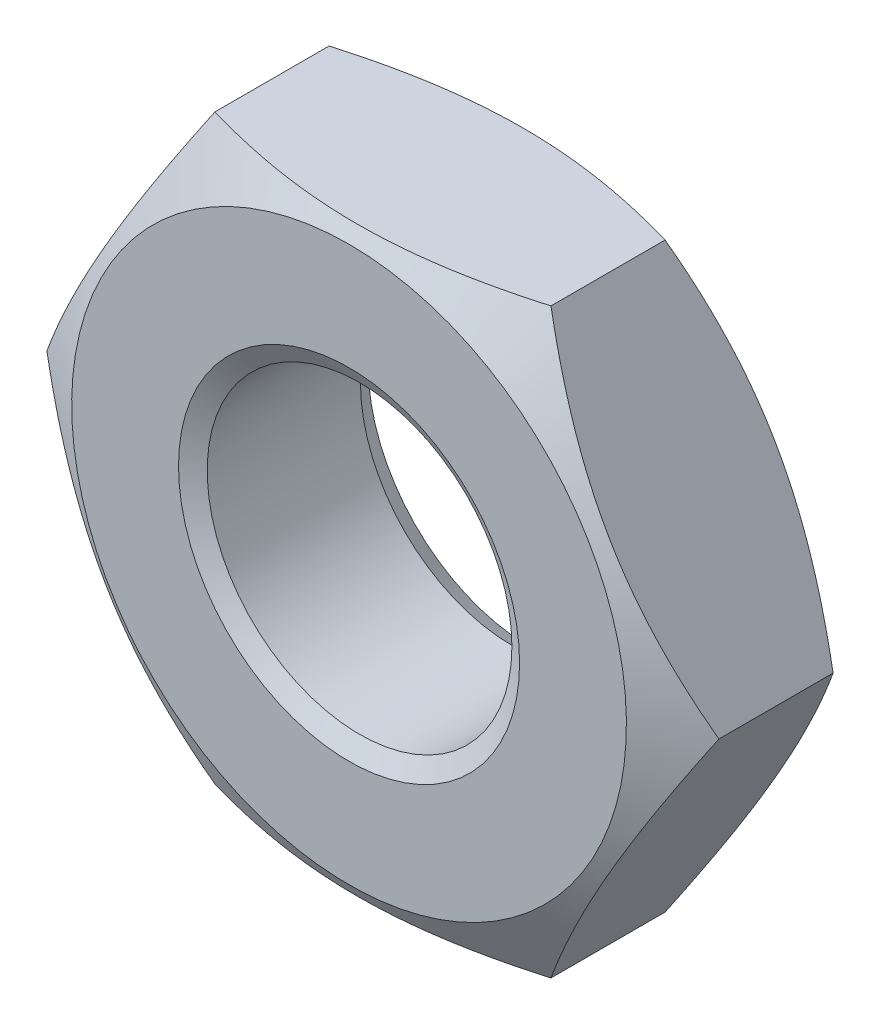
ISO-10303-21;
HEADER;
FILE_DESCRIPTION(('STEP AP214'),'2;1');
FILE_NAME('part.step','',(''),(''),'','','');
FILE_SCHEMA(('AUTOMOTIVE_DESIGN { 1 0 10303 214 1 1 1 1 }'));
ENDSEC;
DATA;
#1=APPLICATION_CONTEXT('core data for automotive mechanical design processes');
#2=APPLICATION_PROTOCOL_DEFINITION('international standard','automotive_design',2000,#1);
#3=PRODUCT_CONTEXT('',#1,'mechanical');
#4=PRODUCT('Part','Part','',(#3));
#5=PRODUCT_RELATED_PRODUCT_CATEGORY('part','',(#4));
#6=PRODUCT_DEFINITION_FORMATION('','',#4);
#7=PRODUCT_DEFINITION_CONTEXT('part definition',#1,'design');
#8=PRODUCT_DEFINITION('design','',#6,#7);
#9=PRODUCT_DEFINITION_SHAPE('','',#8);
#10=(LENGTH_UNIT() NAMED_UNIT(*) SI_UNIT(.MILLI.,.METRE.));
#11=(NAMED_UNIT(*) PLANE_ANGLE_UNIT() SI_UNIT($,.RADIAN.));
#12=(NAMED_UNIT(*) SI_UNIT($,.STERADIAN.) SOLID_ANGLE_UNIT());
#13=UNCERTAINTY_MEASURE_WITH_UNIT(LENGTH_MEASURE(1.E-05),#10,'distance_accuracy_value','');
#14=(GEOMETRIC_REPRESENTATION_CONTEXT(3) GLOBAL_UNCERTAINTY_ASSIGNED_CONTEXT((#13)) GLOBAL_UNIT_ASSIGNED_CONTEXT((#10,
#11,#12)) REPRESENTATION_CONTEXT('',''));
#15=CARTESIAN_POINT('',(0.,0.,0.));
#16=DIRECTION('',(0.,0.,1.));
#17=DIRECTION('',(1.,0.,0.));
#18=AXIS2_PLACEMENT_3D('',#15,#16,#17);
#19=CARTESIAN_POINT('',(-4.618802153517,-8.,0.));
#20=DIRECTION('',(0.,0.,-1.));
#21=DIRECTION('',(-1.,0.,0.));
#22=AXIS2_PLACEMENT_3D('',#19,#20,#21);
#23=PLANE('',#22);
#24=CARTESIAN_POINT('',(0.,0.,0.));
#25=DIRECTION('',(0.,0.,-1.));
#26=DIRECTION('',(0.,1.,0.));
#27=AXIS2_PLACEMENT_3D('',#24,#25,#26);
#28=CIRCLE('',#27,7.625);
#29=CARTESIAN_POINT('',(0.,7.625,0.));
#30=VERTEX_POINT('',#29);
#31=EDGE_CURVE('E136',#30,#30,#28,.T.);
#32=ORIENTED_EDGE('',*,*,#31,.F.);
#33=EDGE_LOOP('',(#32));
#34=FACE_BOUND('',#33,.T.);
#35=CARTESIAN_POINT('',(0.,0.,5.6843418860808E-11));
#36=DIRECTION('',(0.,0.,1.));
#37=DIRECTION('',(1.,0.,0.));
#38=AXIS2_PLACEMENT_3D('',#35,#36,#37);
#39=CIRCLE('',#38,4.68799999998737);
#40=CARTESIAN_POINT('',(4.68799999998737,0.,5.6843418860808E-11));
#41=VERTEX_POINT('',#40);
#42=EDGE_CURVE('E20',#41,#41,#39,.F.);
#43=ORIENTED_EDGE('',*,*,#42,.T.);
#44=EDGE_LOOP('',(#43));
#45=FACE_BOUND('',#44,.T.);
#46=ADVANCED_FACE('F17',(#34,#45),#23,.F.);
#47=CARTESIAN_POINT('',(0.,0.,5.6843418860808E-11));
#48=DIRECTION('',(0.,0.,1.));
#49=DIRECTION('',(1.,0.,0.));
#50=AXIS2_PLACEMENT_3D('',#47,#48,#49);
#51=CONICAL_SURFACE('',#50,4.68799999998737,1.04719755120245);
#52=CARTESIAN_POINT('',(0.,0.,-0.288675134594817));
#53=DIRECTION('',(0.,0.,1.));
#54=DIRECTION('',(1.,0.,0.));
#55=AXIS2_PLACEMENT_3D('',#52,#53,#54);
#56=CIRCLE('',#55,4.188);
#57=CARTESIAN_POINT('',(4.188,0.,-0.288675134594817));
#58=VERTEX_POINT('',#57);
#59=EDGE_CURVE('E71',#58,#58,#56,.F.);
#60=ORIENTED_EDGE('',*,*,#59,.T.);
#61=EDGE_LOOP('',(#60));
#62=FACE_BOUND('',#61,.T.);
#63=ORIENTED_EDGE('',*,*,#42,.F.);
#64=EDGE_LOOP('',(#63));
#65=FACE_BOUND('',#64,.T.);
#66=ADVANCED_FACE('F111',(#62,#65),#51,.F.);
#67=CARTESIAN_POINT('',(0.,0.,-0.936623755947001));
#68=DIRECTION('',(0.,0.,-1.));
#69=DIRECTION('',(0.,1.,0.));
#70=AXIS2_PLACEMENT_3D('',#67,#68,#69);
#71=CONICAL_SURFACE('',#70,9.24727993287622,1.0471975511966);
#72=CARTESIAN_POINT('',(9.23760430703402,0.,-0.931037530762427));
#73=CARTESIAN_POINT('',(9.13607893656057,-0.175847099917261,-0.872433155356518));
#74=CARTESIAN_POINT('',(9.03417504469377,-0.352349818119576,-0.81648866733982));
#75=CARTESIAN_POINT('',(8.82953967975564,-0.70678866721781,-0.710652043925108));
#76=CARTESIAN_POINT('',(8.72680786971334,-0.884725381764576,-0.660762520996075));
#77=CARTESIAN_POINT('',(8.41696767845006,-1.42138433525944,-0.521155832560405));
#78=CARTESIAN_POINT('',(8.20863625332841,-1.78222494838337,-0.441750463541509));
#79=CARTESIAN_POINT('',(7.89687232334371,-2.32221591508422,-0.348640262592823));
#80=CARTESIAN_POINT('',(7.79437112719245,-2.49975319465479,-0.322116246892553));
#81=CARTESIAN_POINT('',(7.5889052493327,-2.8556305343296,-0.27764091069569));
#82=CARTESIAN_POINT('',(7.48594060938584,-3.03397052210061,-0.259688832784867));
#83=CARTESIAN_POINT('',(7.2798340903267,-3.3909574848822,-0.232812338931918));
#84=CARTESIAN_POINT('',(7.17669254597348,-3.5696038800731,-0.223877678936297));
#85=CARTESIAN_POINT('',(6.97031423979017,-3.9270615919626,-0.215227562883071));
#86=CARTESIAN_POINT('',(6.86707748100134,-4.10587290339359,-0.215511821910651));
#87=CARTESIAN_POINT('',(6.67408002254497,-4.44015430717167,-0.224657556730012));
#88=CARTESIAN_POINT('',(6.58430568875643,-4.59564801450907,-0.232403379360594));
#89=CARTESIAN_POINT('',(6.40496729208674,-4.90627122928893,-0.254716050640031));
#90=CARTESIAN_POINT('',(6.31540324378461,-5.06140071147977,-0.269283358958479));
#91=CARTESIAN_POINT('',(6.04705785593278,-5.52618855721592,-0.322873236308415));
#92=CARTESIAN_POINT('',(5.86875148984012,-5.83502424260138,-0.371777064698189));
#93=CARTESIAN_POINT('',(5.51024760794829,-6.4559711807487,-0.494034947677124));
#94=CARTESIAN_POINT('',(5.33009583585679,-6.76800320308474,-0.567907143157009));
#95=CARTESIAN_POINT('',(4.97247850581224,-7.38741458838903,-0.735565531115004));
#96=CARTESIAN_POINT('',(4.79500836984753,-7.69480188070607,-0.829312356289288));
#97=CARTESIAN_POINT('',(4.61880215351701,-8.,-0.931037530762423));
#98=B_SPLINE_CURVE_WITH_KNOTS('',3,(#72,#73,#74,#75,#76,#77,#78,#79,#80,#81,#82,#83,#84,#85,#86,
#87,#88,#89,#90,#91,#92,#93,#94,#95,#96,#97),.UNSPECIFIED.,.F.,.F.,(4,2,2,2,2,2,2,2,2,2,2,2,4),
(0.,0.633965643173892,1.26820385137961,2.53931507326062,3.15930423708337,3.77923860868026,
4.39846792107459,5.01767809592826,5.55669078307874,6.09573979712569,7.17460544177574,
8.27739515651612,9.37802056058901),.UNSPECIFIED.);
#99=CARTESIAN_POINT('',(9.23760430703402,0.,-0.931037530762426));
#100=VERTEX_POINT('',#99);
#101=CARTESIAN_POINT('',(4.61880215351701,-8.,-0.931037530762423));
#102=VERTEX_POINT('',#101);
#103=EDGE_CURVE('E62',#100,#102,#98,.T.);
#104=ORIENTED_EDGE('',*,*,#103,.F.);
#105=CARTESIAN_POINT('',(4.618802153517,8.00000000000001,-0.931037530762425));
#106=CARTESIAN_POINT('',(4.72032752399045,7.82415290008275,-0.872433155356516));
#107=CARTESIAN_POINT('',(4.82223141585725,7.64765018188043,-0.816488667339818));
#108=CARTESIAN_POINT('',(5.02686678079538,7.2932113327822,-0.710652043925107));
#109=CARTESIAN_POINT('',(5.12959859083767,7.11527461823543,-0.660762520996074));
#110=CARTESIAN_POINT('',(5.43943878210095,6.57861566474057,-0.521155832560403));
#111=CARTESIAN_POINT('',(5.6477702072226,6.21777505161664,-0.441750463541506));
#112=CARTESIAN_POINT('',(5.95953413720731,5.67778408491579,-0.348640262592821));
#113=CARTESIAN_POINT('',(6.06203533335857,5.50024680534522,-0.322116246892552));
#114=CARTESIAN_POINT('',(6.26750121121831,5.1443694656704,-0.277640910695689));
#115=CARTESIAN_POINT('',(6.37046585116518,4.9660294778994,-0.259688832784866));
#116=CARTESIAN_POINT('',(6.57657237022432,4.6090425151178,-0.232812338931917));
#117=CARTESIAN_POINT('',(6.67971391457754,4.4303961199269,-0.223877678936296));
#118=CARTESIAN_POINT('',(6.88609222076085,4.07293840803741,-0.215227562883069));
#119=CARTESIAN_POINT('',(6.98932897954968,3.89412709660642,-0.215511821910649));
#120=CARTESIAN_POINT('',(7.18232643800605,3.55984569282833,-0.224657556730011));
#121=CARTESIAN_POINT('',(7.27210077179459,3.40435198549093,-0.232403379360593));
#122=CARTESIAN_POINT('',(7.45143916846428,3.09372877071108,-0.25471605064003));
#123=CARTESIAN_POINT('',(7.54100321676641,2.93859928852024,-0.269283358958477));
#124=CARTESIAN_POINT('',(7.80934860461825,2.47381144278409,-0.322873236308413));
#125=CARTESIAN_POINT('',(7.9876549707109,2.16497575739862,-0.371777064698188));
#126=CARTESIAN_POINT('',(8.34615885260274,1.5440288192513,-0.494034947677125));
#127=CARTESIAN_POINT('',(8.52631062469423,1.23199679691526,-0.567907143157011));
#128=CARTESIAN_POINT('',(8.88392795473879,0.612585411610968,-0.735565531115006));
#129=CARTESIAN_POINT('',(9.0613980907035,0.305198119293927,-0.829312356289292));
#130=CARTESIAN_POINT('',(9.23760430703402,0.,-0.931037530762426));
#131=B_SPLINE_CURVE_WITH_KNOTS('',3,(#105,#106,#107,#108,#109,#110,#111,#112,#113,#114,#115,
#116,#117,#118,#119,#120,#121,#122,#123,#124,#125,#126,#127,#128,#129,#130),.UNSPECIFIED.,.F.,
.F.,(4,2,2,2,2,2,2,2,2,2,2,2,4),(0.,0.63396564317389,1.26820385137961,2.53931507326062,
3.15930423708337,3.77923860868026,4.39846792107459,5.01767809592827,5.55669078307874,
6.09573979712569,7.17460544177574,8.27739515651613,9.37802056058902),.UNSPECIFIED.);
#132=CARTESIAN_POINT('',(4.618802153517,8.,-0.931037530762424));
#133=VERTEX_POINT('',#132);
#134=EDGE_CURVE('E66',#133,#100,#131,.T.);
#135=ORIENTED_EDGE('',*,*,#134,.F.);
#136=CARTESIAN_POINT('',(-4.61880215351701,8.,-0.931037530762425));
#137=CARTESIAN_POINT('',(-4.41575141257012,8.,-0.872433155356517));
#138=CARTESIAN_POINT('',(-4.21194362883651,8.,-0.816488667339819));
#139=CARTESIAN_POINT('',(-3.80267289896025,8.,-0.710652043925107));
#140=CARTESIAN_POINT('',(-3.59720927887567,8.,-0.660762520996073));
#141=CARTESIAN_POINT('',(-2.9775288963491,8.,-0.521155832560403));
#142=CARTESIAN_POINT('',(-2.5608660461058,8.,-0.441750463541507));
#143=CARTESIAN_POINT('',(-1.9373381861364,8.,-0.348640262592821));
#144=CARTESIAN_POINT('',(-1.73233579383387,8.,-0.322116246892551));
#145=CARTESIAN_POINT('',(-1.32140403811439,8.,-0.277640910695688));
#146=CARTESIAN_POINT('',(-1.11547475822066,8.,-0.259688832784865));
#147=CARTESIAN_POINT('',(-0.703261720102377,8.,-0.232812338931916));
#148=CARTESIAN_POINT('',(-0.496978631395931,8.,-0.223877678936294));
#149=CARTESIAN_POINT('',(-0.0842220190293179,8.,-0.215227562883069));
#150=CARTESIAN_POINT('',(0.122251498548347,8.,-0.215511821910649));
#151=CARTESIAN_POINT('',(0.508246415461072,8.,-0.22465755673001));
#152=CARTESIAN_POINT('',(0.687795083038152,8.,-0.232403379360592));
#153=CARTESIAN_POINT('',(1.04647187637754,8.,-0.254716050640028));
#154=CARTESIAN_POINT('',(1.2255999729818,8.,-0.269283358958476));
#155=CARTESIAN_POINT('',(1.76229074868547,8.,-0.322873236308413));
#156=CARTESIAN_POINT('',(2.11890348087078,8.,-0.371777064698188));
#157=CARTESIAN_POINT('',(2.83591124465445,8.,-0.494034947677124));
#158=CARTESIAN_POINT('',(3.19621478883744,8.,-0.567907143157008));
#159=CARTESIAN_POINT('',(3.91144944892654,8.,-0.735565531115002));
#160=CARTESIAN_POINT('',(4.26638972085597,8.,-0.829312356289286));
#161=CARTESIAN_POINT('',(4.618802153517,8.,-0.931037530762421));
#162=B_SPLINE_CURVE_WITH_KNOTS('',3,(#136,#137,#138,#139,#140,#141,#142,#143,#144,#145,#146,
#147,#148,#149,#150,#151,#152,#153,#154,#155,#156,#157,#158,#159,#160,#161),.UNSPECIFIED.,.F.,
.F.,(4,2,2,2,2,2,2,2,2,2,2,2,4),(0.,0.63396564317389,1.26820385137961,2.53931507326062,
3.15930423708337,3.77923860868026,4.39846792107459,5.01767809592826,5.55669078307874,
6.09573979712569,7.17460544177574,8.27739515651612,9.37802056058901),.UNSPECIFIED.);
#163=CARTESIAN_POINT('',(-4.61880215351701,8.,-0.931037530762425));
#164=VERTEX_POINT('',#163);
#165=EDGE_CURVE('E85',#164,#133,#162,.T.);
#166=ORIENTED_EDGE('',*,*,#165,.F.);
#167=CARTESIAN_POINT('',(-9.23760430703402,0.,-0.931037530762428));
#168=CARTESIAN_POINT('',(-9.13607893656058,0.17584709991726,-0.872433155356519));
#169=CARTESIAN_POINT('',(-9.03417504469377,0.352349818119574,-0.81648866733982));
#170=CARTESIAN_POINT('',(-8.82953967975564,0.706788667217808,-0.710652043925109));
#171=CARTESIAN_POINT('',(-8.72680786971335,0.884725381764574,-0.660762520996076));
#172=CARTESIAN_POINT('',(-8.41696767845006,1.42138433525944,-0.521155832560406));
#173=CARTESIAN_POINT('',(-8.20863625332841,1.78222494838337,-0.441750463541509));
#174=CARTESIAN_POINT('',(-7.89687232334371,2.32221591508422,-0.348640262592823));
#175=CARTESIAN_POINT('',(-7.79437112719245,2.49975319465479,-0.322116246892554));
#176=CARTESIAN_POINT('',(-7.58890524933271,2.85563053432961,-0.277640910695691));
#177=CARTESIAN_POINT('',(-7.48594060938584,3.03397052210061,-0.259688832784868));
#178=CARTESIAN_POINT('',(-7.2798340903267,3.3909574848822,-0.23281233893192));
#179=CARTESIAN_POINT('',(-7.17669254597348,3.5696038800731,-0.223877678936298));
#180=CARTESIAN_POINT('',(-6.97031423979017,3.9270615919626,-0.215227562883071));
#181=CARTESIAN_POINT('',(-6.86707748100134,4.10587290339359,-0.215511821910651));
#182=CARTESIAN_POINT('',(-6.67408002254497,4.44015430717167,-0.224657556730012));
#183=CARTESIAN_POINT('',(-6.58430568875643,4.59564801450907,-0.232403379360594));
#184=CARTESIAN_POINT('',(-6.40496729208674,4.90627122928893,-0.254716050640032));
#185=CARTESIAN_POINT('',(-6.31540324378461,5.06140071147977,-0.269283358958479));
#186=CARTESIAN_POINT('',(-6.04705785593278,5.52618855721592,-0.322873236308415));
#187=CARTESIAN_POINT('',(-5.86875148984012,5.83502424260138,-0.37177706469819));
#188=CARTESIAN_POINT('',(-5.51024760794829,6.4559711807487,-0.494034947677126));
#189=CARTESIAN_POINT('',(-5.33009583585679,6.76800320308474,-0.567907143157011));
#190=CARTESIAN_POINT('',(-4.97247850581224,7.38741458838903,-0.735565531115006));
#191=CARTESIAN_POINT('',(-4.79500836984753,7.69480188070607,-0.829312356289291));
#192=CARTESIAN_POINT('',(-4.61880215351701,8.,-0.931037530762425));
#193=B_SPLINE_CURVE_WITH_KNOTS('',3,(#167,#168,#169,#170,#171,#172,#173,#174,#175,#176,#177,
#178,#179,#180,#181,#182,#183,#184,#185,#186,#187,#188,#189,#190,#191,#192),.UNSPECIFIED.,.F.,
.F.,(4,2,2,2,2,2,2,2,2,2,2,2,4),(0.,0.633965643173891,1.26820385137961,2.53931507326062,
3.15930423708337,3.77923860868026,4.39846792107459,5.01767809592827,5.55669078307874,
6.09573979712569,7.17460544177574,8.27739515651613,9.37802056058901),.UNSPECIFIED.);
#194=CARTESIAN_POINT('',(-9.23760430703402,0.,-0.931037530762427));
#195=VERTEX_POINT('',#194);
#196=EDGE_CURVE('E114',#195,#164,#193,.T.);
#197=ORIENTED_EDGE('',*,*,#196,.F.);
#198=CARTESIAN_POINT('',(-4.618802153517,-8.00000000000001,-0.931037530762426));
#199=CARTESIAN_POINT('',(-4.72032752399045,-7.82415290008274,-0.872433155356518));
#200=CARTESIAN_POINT('',(-4.82223141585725,-7.64765018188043,-0.816488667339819));
#201=CARTESIAN_POINT('',(-5.02686678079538,-7.2932113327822,-0.710652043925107));
#202=CARTESIAN_POINT('',(-5.12959859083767,-7.11527461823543,-0.660762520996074));
#203=CARTESIAN_POINT('',(-5.43943878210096,-6.57861566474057,-0.521155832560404));
#204=CARTESIAN_POINT('',(-5.64777020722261,-6.21777505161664,-0.441750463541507));
#205=CARTESIAN_POINT('',(-5.95953413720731,-5.67778408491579,-0.348640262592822));
#206=CARTESIAN_POINT('',(-6.06203533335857,-5.50024680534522,-0.322116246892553));
#207=CARTESIAN_POINT('',(-6.26750121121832,-5.1443694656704,-0.277640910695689));
#208=CARTESIAN_POINT('',(-6.37046585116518,-4.9660294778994,-0.259688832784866));
#209=CARTESIAN_POINT('',(-6.57657237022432,-4.6090425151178,-0.232812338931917));
#210=CARTESIAN_POINT('',(-6.67971391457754,-4.4303961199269,-0.223877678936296));
#211=CARTESIAN_POINT('',(-6.88609222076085,-4.07293840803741,-0.21522756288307));
#212=CARTESIAN_POINT('',(-6.98932897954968,-3.89412709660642,-0.215511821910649));
#213=CARTESIAN_POINT('',(-7.18232643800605,-3.55984569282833,-0.224657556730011));
#214=CARTESIAN_POINT('',(-7.27210077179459,-3.40435198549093,-0.232403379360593));
#215=CARTESIAN_POINT('',(-7.45143916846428,-3.09372877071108,-0.25471605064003));
#216=CARTESIAN_POINT('',(-7.54100321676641,-2.93859928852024,-0.269283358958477));
#217=CARTESIAN_POINT('',(-7.80934860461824,-2.47381144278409,-0.322873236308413));
#218=CARTESIAN_POINT('',(-7.9876549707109,-2.16497575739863,-0.371777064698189));
#219=CARTESIAN_POINT('',(-8.34615885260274,-1.5440288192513,-0.494034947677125));
#220=CARTESIAN_POINT('',(-8.52631062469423,-1.23199679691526,-0.56790714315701));
#221=CARTESIAN_POINT('',(-8.88392795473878,-0.612585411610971,-0.735565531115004));
#222=CARTESIAN_POINT('',(-9.0613980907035,-0.305198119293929,-0.82931235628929));
#223=CARTESIAN_POINT('',(-9.23760430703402,0.,-0.931037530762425));
#224=B_SPLINE_CURVE_WITH_KNOTS('',3,(#198,#199,#200,#201,#202,#203,#204,#205,#206,#207,#208,
#209,#210,#211,#212,#213,#214,#215,#216,#217,#218,#219,#220,#221,#222,#223),.UNSPECIFIED.,.F.,
.F.,(4,2,2,2,2,2,2,2,2,2,2,2,4),(0.,0.633965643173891,1.26820385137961,2.53931507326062,
3.15930423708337,3.77923860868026,4.39846792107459,5.01767809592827,5.55669078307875,
6.09573979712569,7.17460544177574,8.27739515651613,9.37802056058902),.UNSPECIFIED.);
#225=CARTESIAN_POINT('',(-4.618802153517,-8.,-0.931037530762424));
#226=VERTEX_POINT('',#225);
#227=EDGE_CURVE('E122',#226,#195,#224,.T.);
#228=ORIENTED_EDGE('',*,*,#227,.F.);
#229=CARTESIAN_POINT('',(4.61880215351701,-8.,-0.931037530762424));
#230=CARTESIAN_POINT('',(4.41575141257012,-8.,-0.872433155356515));
#231=CARTESIAN_POINT('',(4.2119436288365,-8.,-0.816488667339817));
#232=CARTESIAN_POINT('',(3.80267289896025,-8.,-0.710652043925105));
#233=CARTESIAN_POINT('',(3.59720927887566,-8.,-0.660762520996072));
#234=CARTESIAN_POINT('',(2.9775288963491,-8.,-0.521155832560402));
#235=CARTESIAN_POINT('',(2.5608660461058,-8.,-0.441750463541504));
#236=CARTESIAN_POINT('',(1.9373381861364,-8.,-0.348640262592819));
#237=CARTESIAN_POINT('',(1.73233579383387,-8.,-0.32211624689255));
#238=CARTESIAN_POINT('',(1.32140403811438,-8.,-0.277640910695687));
#239=CARTESIAN_POINT('',(1.11547475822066,-8.,-0.259688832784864));
#240=CARTESIAN_POINT('',(0.703261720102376,-8.,-0.232812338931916));
#241=CARTESIAN_POINT('',(0.49697863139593,-8.,-0.223877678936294));
#242=CARTESIAN_POINT('',(0.0842220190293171,-8.,-0.215227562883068));
#243=CARTESIAN_POINT('',(-0.122251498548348,-8.,-0.215511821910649));
#244=CARTESIAN_POINT('',(-0.508246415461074,-8.,-0.22465755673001));
#245=CARTESIAN_POINT('',(-0.687795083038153,-8.,-0.232403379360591));
#246=CARTESIAN_POINT('',(-1.04647187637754,-8.,-0.254716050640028));
#247=CARTESIAN_POINT('',(-1.2255999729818,-8.,-0.269283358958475));
#248=CARTESIAN_POINT('',(-1.76229074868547,-8.,-0.322873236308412));
#249=CARTESIAN_POINT('',(-2.11890348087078,-8.,-0.371777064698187));
#250=CARTESIAN_POINT('',(-2.83591124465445,-8.,-0.494034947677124));
#251=CARTESIAN_POINT('',(-3.19621478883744,-8.,-0.567907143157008));
#252=CARTESIAN_POINT('',(-3.91144944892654,-8.,-0.735565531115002));
#253=CARTESIAN_POINT('',(-4.26638972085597,-8.,-0.829312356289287));
#254=CARTESIAN_POINT('',(-4.618802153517,-8.,-0.931037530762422));
#255=B_SPLINE_CURVE_WITH_KNOTS('',3,(#229,#230,#231,#232,#233,#234,#235,#236,#237,#238,#239,
#240,#241,#242,#243,#244,#245,#246,#247,#248,#249,#250,#251,#252,#253,#254),.UNSPECIFIED.,.F.,
.F.,(4,2,2,2,2,2,2,2,2,2,2,2,4),(0.,0.633965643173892,1.26820385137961,2.53931507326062,
3.15930423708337,3.77923860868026,4.39846792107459,5.01767809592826,5.55669078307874,
6.09573979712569,7.17460544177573,8.27739515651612,9.37802056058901),.UNSPECIFIED.);
#256=EDGE_CURVE('E69',#102,#226,#255,.T.);
#257=ORIENTED_EDGE('',*,*,#256,.F.);
#258=EDGE_LOOP('',(#104,#135,#166,#197,#228,#257));
#259=FACE_BOUND('',#258,.T.);
#260=ORIENTED_EDGE('',*,*,#31,.T.);
#261=EDGE_LOOP('',(#260));
#262=FACE_BOUND('',#261,.T.);
#263=ADVANCED_FACE('F63',(#259,#262),#71,.T.);
#264=CARTESIAN_POINT('',(0.,0.,-5.));
#265=DIRECTION('',(0.,0.,1.));
#266=DIRECTION('',(1.,0.,0.));
#267=AXIS2_PLACEMENT_3D('',#264,#265,#266);
#268=CYLINDRICAL_SURFACE('',#267,4.188);
#269=CARTESIAN_POINT('',(0.,0.,-4.50000000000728));
#270=DIRECTION('',(0.,0.,-1.));
#271=DIRECTION('',(-1.,0.,0.));
#272=AXIS2_PLACEMENT_3D('',#269,#270,#271);
#273=CIRCLE('',#272,4.18799999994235);
#274=CARTESIAN_POINT('',(-4.18799999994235,0.,-4.50000000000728));
#275=VERTEX_POINT('',#274);
#276=EDGE_CURVE('E185',#275,#275,#273,.T.);
#277=ORIENTED_EDGE('',*,*,#276,.T.);
#278=EDGE_LOOP('',(#277));
#279=FACE_BOUND('',#278,.T.);
#280=ORIENTED_EDGE('',*,*,#59,.F.);
#281=EDGE_LOOP('',(#280));
#282=FACE_BOUND('',#281,.T.);
#283=ADVANCED_FACE('F110',(#279,#282),#268,.F.);
#284=CARTESIAN_POINT('',(4.61880215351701,-8.,-5.));
#285=DIRECTION('',(0.866025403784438,-0.5,0.));
#286=DIRECTION('',(0.5,0.866025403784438,0.));
#287=AXIS2_PLACEMENT_3D('',#284,#285,#286);
#288=PLANE('',#287);
#289=CARTESIAN_POINT('',(9.23760430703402,0.,-4.06896246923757));
#290=CARTESIAN_POINT('',(9.13607893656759,-0.175847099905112,-4.12756684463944));
#291=CARTESIAN_POINT('',(9.03417504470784,-0.352349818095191,-4.18351133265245));
#292=CARTESIAN_POINT('',(8.82953967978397,-0.706788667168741,-4.28934795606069));
#293=CARTESIAN_POINT('',(8.72680786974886,-0.88472538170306,-4.33923747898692));
#294=CARTESIAN_POINT('',(8.41696767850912,-1.42138433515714,-4.47884416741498));
#295=CARTESIAN_POINT('',(8.20863625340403,-1.7822249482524,-4.55824953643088));
#296=CARTESIAN_POINT('',(7.89687232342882,-2.32221591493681,-4.65135973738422));
#297=CARTESIAN_POINT('',(7.79437112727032,-2.49975319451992,-4.67788375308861));
#298=CARTESIAN_POINT('',(7.588905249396,-2.85563053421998,-4.72235908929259));
#299=CARTESIAN_POINT('',(7.4859406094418,-3.03397052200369,-4.74031116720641));
#300=CARTESIAN_POINT('',(7.2798340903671,-3.39095748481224,-4.76718766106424));
#301=CARTESIAN_POINT('',(7.17669254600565,-3.56960388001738,-4.77612232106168));
#302=CARTESIAN_POINT('',(6.97031423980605,-3.9270615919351,-4.78477243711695));
#303=CARTESIAN_POINT('',(6.86707748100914,-4.10587290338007,-4.78448817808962));
#304=CARTESIAN_POINT('',(6.6740800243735,-4.44015430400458,-4.77534244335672));
#305=CARTESIAN_POINT('',(6.58430569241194,-4.59564800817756,-4.76759662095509));
#306=CARTESIAN_POINT('',(6.40496729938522,-4.90627121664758,-4.74528395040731));
#307=CARTESIAN_POINT('',(6.31540325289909,-5.06140069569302,-4.73071664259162));
#308=CARTESIAN_POINT('',(6.04705787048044,-5.52618853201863,-4.67712676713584));
#309=CARTESIAN_POINT('',(5.86875150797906,-5.83502421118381,-4.62822294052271));
#310=CARTESIAN_POINT('',(5.51024763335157,-6.45597113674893,-4.50596506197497));
#311=CARTESIAN_POINT('',(5.33009586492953,-6.76800315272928,-4.43209286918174));
#312=CARTESIAN_POINT('',(4.97247854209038,-7.38741452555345,-4.26443448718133));
#313=CARTESIAN_POINT('',(4.79500840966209,-7.69480181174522,-4.17068766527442));
#314=CARTESIAN_POINT('',(4.6188021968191,-7.99999992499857,-4.06896249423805));
#315=B_SPLINE_CURVE_WITH_KNOTS('',3,(#289,#290,#291,#292,#293,#294,#295,#296,#297,#298,#299,
#300,#301,#302,#303,#304,#305,#306,#307,#308,#309,#310,#311,#312,#313,#314),.UNSPECIFIED.,.F.,
.F.,(4,2,2,2,2,2,2,2,2,2,2,2,4),(0.,0.633965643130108,1.26820385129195,2.53931507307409,
3.15930423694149,3.77923860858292,4.39846792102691,5.01767809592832,5.55669077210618,
6.09573977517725,7.17460539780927,8.27739508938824,9.37802047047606),.UNSPECIFIED.);
#316=CARTESIAN_POINT('',(9.23760430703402,0.,-4.06896246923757));
#317=VERTEX_POINT('',#316);
#318=CARTESIAN_POINT('',(4.61880217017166,-8.,-4.06896246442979));
#319=VERTEX_POINT('',#318);
#320=EDGE_CURVE('E35',#317,#319,#315,.T.);
#321=ORIENTED_EDGE('',*,*,#320,.F.);
#322=DIRECTION('',(0.,0.,1.));
#323=VECTOR('',#322,1.);
#324=CARTESIAN_POINT('',(9.23760430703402,0.,-5.));
#325=LINE('',#324,#323);
#326=EDGE_CURVE('E73',#100,#317,#325,.F.);
#327=ORIENTED_EDGE('',*,*,#326,.F.);
#328=ORIENTED_EDGE('',*,*,#103,.T.);
#329=DIRECTION('',(0.,0.,1.));
#330=VECTOR('',#329,1.);
#331=CARTESIAN_POINT('',(4.618802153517,-8.,-5.));
#332=LINE('',#331,#330);
#333=EDGE_CURVE('E188',#319,#102,#332,.T.);
#334=ORIENTED_EDGE('',*,*,#333,.F.);
#335=EDGE_LOOP('',(#321,#327,#328,#334));
#336=FACE_BOUND('',#335,.T.);
#337=ADVANCED_FACE('F74',(#336),#288,.T.);
#338=CARTESIAN_POINT('',(-4.618802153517,-8.,-5.));
#339=DIRECTION('',(0.,-1.,0.));
#340=DIRECTION('',(1.,0.,0.));
#341=AXIS2_PLACEMENT_3D('',#338,#339,#340);
#342=PLANE('',#341);
#343=CARTESIAN_POINT('',(4.61880218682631,-8.,-4.06896245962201));
#344=CARTESIAN_POINT('',(4.41575144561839,-8.,-4.12756683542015));
#345=CARTESIAN_POINT('',(4.21194366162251,-8.,-4.18351132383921));
#346=CARTESIAN_POINT('',(3.80267293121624,-8.,-4.28934794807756));
#347=CARTESIAN_POINT('',(3.59720931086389,-8.,-4.33923747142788));
#348=CARTESIAN_POINT('',(2.97752892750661,-8.,-4.47884416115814));
#349=CARTESIAN_POINT('',(2.5608660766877,-8.,-4.5582495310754));
#350=CARTESIAN_POINT('',(1.93733821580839,-8.,-4.65135973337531));
#351=CARTESIAN_POINT('',(1.73233582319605,-8.,-4.67788374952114));
#352=CARTESIAN_POINT('',(1.32140406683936,-8.,-4.72235908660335));
#353=CARTESIAN_POINT('',(1.11547478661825,-8.,-4.74031116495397));
#354=CARTESIAN_POINT('',(0.703261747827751,-8.,-4.76718765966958));
#355=CARTESIAN_POINT('',(0.496978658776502,-8.,-4.77612232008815));
#356=CARTESIAN_POINT('',(0.0842220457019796,-8.,-4.78477243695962));
#357=CARTESIAN_POINT('',(-0.12225147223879,-8.,-4.78448817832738));
#358=CARTESIAN_POINT('',(-0.508246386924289,-8.,-4.77534244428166));
#359=CARTESIAN_POINT('',(-0.687795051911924,-8.,-4.76759662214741));
#360=CARTESIAN_POINT('',(-1.04647184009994,-8.,-4.74528395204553));
#361=CARTESIAN_POINT('',(-1.22559993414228,-8.,-4.73071664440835));
#362=CARTESIAN_POINT('',(-1.76229070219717,-8.,-4.67712676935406));
#363=CARTESIAN_POINT('',(-2.11890342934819,-8.,-4.62822294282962));
#364=CARTESIAN_POINT('',(-2.83591118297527,-8.,-4.50596506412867));
#365=CARTESIAN_POINT('',(-3.19621472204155,-8.,-4.43209287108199));
#366=CARTESIAN_POINT('',(-3.9114493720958,-8.,-4.26443448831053));
#367=CARTESIAN_POINT('',(-4.26638963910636,-8.,-4.17068766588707));
#368=CARTESIAN_POINT('',(-4.6188020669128,-8.,-4.06896249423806));
#369=B_SPLINE_CURVE_WITH_KNOTS('',3,(#343,#344,#345,#346,#347,#348,#349,#350,#351,#352,#353,
#354,#355,#356,#357,#358,#359,#360,#361,#362,#363,#364,#365,#366,#367,#368),.UNSPECIFIED.,.F.,
.F.,(4,2,2,2,2,2,2,2,2,2,2,2,4),(0.,0.633965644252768,1.26820385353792,2.53931507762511,
3.15930424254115,3.77923861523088,4.39846792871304,5.01767810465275,5.55669078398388,
6.09573979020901,7.17460541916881,8.27739511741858,9.37802050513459),.UNSPECIFIED.);
#370=CARTESIAN_POINT('',(-4.61880214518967,-8.00000001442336,-4.06896246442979));
#371=VERTEX_POINT('',#370);
#372=EDGE_CURVE('E147',#319,#371,#369,.T.);
#373=ORIENTED_EDGE('',*,*,#372,.F.);
#374=ORIENTED_EDGE('',*,*,#333,.T.);
#375=ORIENTED_EDGE('',*,*,#256,.T.);
#376=DIRECTION('',(0.,0.,1.));
#377=VECTOR('',#376,1.);
#378=CARTESIAN_POINT('',(-4.618802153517,-8.00000000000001,-5.));
#379=LINE('',#378,#377);
#380=EDGE_CURVE('E190',#371,#226,#379,.T.);
#381=ORIENTED_EDGE('',*,*,#380,.F.);
#382=EDGE_LOOP('',(#373,#374,#375,#381));
#383=FACE_BOUND('',#382,.T.);
#384=ADVANCED_FACE('F139',(#383),#342,.T.);
#385=CARTESIAN_POINT('',(-9.23760430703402,0.,-5.));
#386=DIRECTION('',(-0.866025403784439,-0.5,0.));
#387=DIRECTION('',(0.5,-0.866025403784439,0.));
#388=AXIS2_PLACEMENT_3D('',#385,#386,#387);
#389=PLANE('',#388);
#390=CARTESIAN_POINT('',(-4.61880213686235,-8.00000002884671,-4.06896245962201));
#391=CARTESIAN_POINT('',(-4.72032750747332,-7.82415292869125,-4.1275668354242));
#392=CARTESIAN_POINT('',(-4.82223139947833,-7.64765021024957,-4.18351132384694));
#393=CARTESIAN_POINT('',(-5.02686676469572,-7.29321136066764,-4.28934794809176));
#394=CARTESIAN_POINT('',(-5.12959857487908,-7.11527464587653,-4.33923747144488));
#395=CARTESIAN_POINT('',(-5.43943876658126,-6.57861569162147,-4.47884416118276));
#396=CARTESIAN_POINT('',(-5.64777019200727,-6.21777507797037,-4.558249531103));
#397=CARTESIAN_POINT('',(-5.95953412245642,-5.67778411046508,-4.65135973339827));
#398=CARTESIAN_POINT('',(-6.06203531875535,-5.50024683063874,-4.67788374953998));
#399=CARTESIAN_POINT('',(-6.26750119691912,-5.14436949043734,-4.72235908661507));
#400=CARTESIAN_POINT('',(-6.37046583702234,-4.96602950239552,-4.74031116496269));
#401=CARTESIAN_POINT('',(-6.57657235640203,-4.60904253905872,-4.76718765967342));
#402=CARTESIAN_POINT('',(-6.67971390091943,-4.43039614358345,-4.77612232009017));
#403=CARTESIAN_POINT('',(-6.88609220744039,-4.07293843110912,-4.78477243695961));
#404=CARTESIAN_POINT('',(-6.98932896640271,-3.89412711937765,-4.7844881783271));
#405=CARTESIAN_POINT('',(-7.18232642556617,-3.55984571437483,-4.77534244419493));
#406=CARTESIAN_POINT('',(-7.27210075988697,-3.40435200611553,-4.76759662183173));
#407=CARTESIAN_POINT('',(-7.45143915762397,-3.09372878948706,-4.7452839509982));
#408=CARTESIAN_POINT('',(-7.54100320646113,-2.9385993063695,-4.73071664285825));
#409=CARTESIAN_POINT('',(-7.80934859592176,-2.47381145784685,-4.67712676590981));
#410=CARTESIAN_POINT('',(-7.98765496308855,-2.16497577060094,-4.62822293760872));
#411=CARTESIAN_POINT('',(-8.34615884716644,-1.54402882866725,-4.50596505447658));
#412=CARTESIAN_POINT('',(-8.52631062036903,-1.23199680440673,-4.43209285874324));
#413=CARTESIAN_POINT('',(-8.88392795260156,-0.612585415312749,-4.26443447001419));
#414=CARTESIAN_POINT('',(-9.06139808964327,-0.305198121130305,-4.17068764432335));
#415=CARTESIAN_POINT('',(-9.23760430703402,0.,-4.06896246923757));
#416=B_SPLINE_CURVE_WITH_KNOTS('',3,(#390,#391,#392,#393,#394,#395,#396,#397,#398,#399,#400,
#401,#402,#403,#404,#405,#406,#407,#408,#409,#410,#411,#412,#413,#414,#415),.UNSPECIFIED.,.F.,
.F.,(4,2,2,2,2,2,2,2,2,2,2,2,4),(0.,0.633965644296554,1.26820385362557,2.53931507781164,
3.15930424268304,3.77923861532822,4.39846792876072,5.0176781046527,5.55669079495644,
6.09573981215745,7.1746054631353,8.27739518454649,9.37802059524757),.UNSPECIFIED.);
#417=CARTESIAN_POINT('',(-9.23760430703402,0.,-4.06896246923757));
#418=VERTEX_POINT('',#417);
#419=EDGE_CURVE('E153',#371,#418,#416,.T.);
#420=ORIENTED_EDGE('',*,*,#419,.F.);
#421=ORIENTED_EDGE('',*,*,#380,.T.);
#422=ORIENTED_EDGE('',*,*,#227,.T.);
#423=DIRECTION('',(0.,0.,1.));
#424=VECTOR('',#423,1.);
#425=CARTESIAN_POINT('',(-9.23760430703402,0.,-5.));
#426=LINE('',#425,#424);
#427=EDGE_CURVE('E193',#418,#195,#426,.T.);
#428=ORIENTED_EDGE('',*,*,#427,.F.);
#429=EDGE_LOOP('',(#420,#421,#422,#428));
#430=FACE_BOUND('',#429,.T.);
#431=ADVANCED_FACE('F143',(#430),#389,.T.);
#432=CARTESIAN_POINT('',(-4.61880215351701,8.,-5.));
#433=DIRECTION('',(-0.866025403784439,0.5,0.));
#434=DIRECTION('',(-0.5,-0.866025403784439,0.));
#435=AXIS2_PLACEMENT_3D('',#432,#433,#434);
#436=PLANE('',#435);
#437=CARTESIAN_POINT('',(-9.23760430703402,0.,-4.06896246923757));
#438=CARTESIAN_POINT('',(-9.13607893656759,0.175847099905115,-4.12756684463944));
#439=CARTESIAN_POINT('',(-9.03417504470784,0.352349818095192,-4.18351133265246));
#440=CARTESIAN_POINT('',(-8.82953967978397,0.706788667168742,-4.28934795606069));
#441=CARTESIAN_POINT('',(-8.72680786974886,0.884725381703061,-4.33923747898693));
#442=CARTESIAN_POINT('',(-8.41696767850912,1.42138433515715,-4.47884416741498));
#443=CARTESIAN_POINT('',(-8.20863625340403,1.7822249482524,-4.55824953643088));
#444=CARTESIAN_POINT('',(-7.89687232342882,2.32221591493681,-4.65135973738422));
#445=CARTESIAN_POINT('',(-7.79437112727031,2.49975319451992,-4.67788375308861));
#446=CARTESIAN_POINT('',(-7.58890524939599,2.85563053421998,-4.72235908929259));
#447=CARTESIAN_POINT('',(-7.48594060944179,3.0339705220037,-4.74031116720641));
#448=CARTESIAN_POINT('',(-7.2798340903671,3.39095748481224,-4.76718766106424));
#449=CARTESIAN_POINT('',(-7.17669254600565,3.56960388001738,-4.77612232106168));
#450=CARTESIAN_POINT('',(-6.97031423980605,3.9270615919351,-4.78477243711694));
#451=CARTESIAN_POINT('',(-6.86707748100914,4.10587290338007,-4.78448817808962));
#452=CARTESIAN_POINT('',(-6.6740800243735,4.44015430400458,-4.77534244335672));
#453=CARTESIAN_POINT('',(-6.58430569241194,4.59564800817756,-4.76759662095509));
#454=CARTESIAN_POINT('',(-6.40496729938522,4.90627121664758,-4.74528395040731));
#455=CARTESIAN_POINT('',(-6.31540325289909,5.06140069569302,-4.73071664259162));
#456=CARTESIAN_POINT('',(-6.04705787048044,5.52618853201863,-4.67712676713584));
#457=CARTESIAN_POINT('',(-5.86875150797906,5.83502421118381,-4.62822294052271));
#458=CARTESIAN_POINT('',(-5.51024763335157,6.45597113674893,-4.50596506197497));
#459=CARTESIAN_POINT('',(-5.33009586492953,6.76800315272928,-4.43209286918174));
#460=CARTESIAN_POINT('',(-4.97247854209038,7.38741452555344,-4.26443448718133));
#461=CARTESIAN_POINT('',(-4.79500840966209,7.69480181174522,-4.17068766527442));
#462=CARTESIAN_POINT('',(-4.61880219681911,7.99999992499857,-4.06896249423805));
#463=B_SPLINE_CURVE_WITH_KNOTS('',3,(#437,#438,#439,#440,#441,#442,#443,#444,#445,#446,#447,
#448,#449,#450,#451,#452,#453,#454,#455,#456,#457,#458,#459,#460,#461,#462),.UNSPECIFIED.,.F.,
.F.,(4,2,2,2,2,2,2,2,2,2,2,2,4),(0.,0.633965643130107,1.26820385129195,2.53931507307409,
3.15930423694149,3.77923860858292,4.39846792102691,5.01767809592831,5.55669077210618,
6.09573977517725,7.17460539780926,8.27739508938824,9.37802047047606),.UNSPECIFIED.);
#464=CARTESIAN_POINT('',(-4.61880217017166,8.,-4.06896246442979));
#465=VERTEX_POINT('',#464);
#466=EDGE_CURVE('E210',#418,#465,#463,.T.);
#467=ORIENTED_EDGE('',*,*,#466,.F.);
#468=ORIENTED_EDGE('',*,*,#427,.T.);
#469=ORIENTED_EDGE('',*,*,#196,.T.);
#470=DIRECTION('',(0.,0.,1.));
#471=VECTOR('',#470,1.);
#472=CARTESIAN_POINT('',(-4.61880215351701,8.,-5.));
#473=LINE('',#472,#471);
#474=EDGE_CURVE('E82',#465,#164,#473,.T.);
#475=ORIENTED_EDGE('',*,*,#474,.F.);
#476=EDGE_LOOP('',(#467,#468,#469,#475));
#477=FACE_BOUND('',#476,.T.);
#478=ADVANCED_FACE('F201',(#477),#436,.T.);
#479=CARTESIAN_POINT('',(4.618802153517,8.,-5.));
#480=DIRECTION('',(0.,1.,0.));
#481=DIRECTION('',(0.,0.,1.));
#482=AXIS2_PLACEMENT_3D('',#479,#480,#481);
#483=PLANE('',#482);
#484=CARTESIAN_POINT('',(-4.61880218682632,8.,-4.06896245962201));
#485=CARTESIAN_POINT('',(-4.4157514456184,8.,-4.12756683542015));
#486=CARTESIAN_POINT('',(-4.21194366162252,8.,-4.18351132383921));
#487=CARTESIAN_POINT('',(-3.80267293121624,8.,-4.28934794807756));
#488=CARTESIAN_POINT('',(-3.59720931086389,8.,-4.33923747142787));
#489=CARTESIAN_POINT('',(-2.97752892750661,8.,-4.47884416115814));
#490=CARTESIAN_POINT('',(-2.56086607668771,8.,-4.55824953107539));
#491=CARTESIAN_POINT('',(-1.93733821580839,8.,-4.65135973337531));
#492=CARTESIAN_POINT('',(-1.73233582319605,8.,-4.67788374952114));
#493=CARTESIAN_POINT('',(-1.32140406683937,8.,-4.72235908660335));
#494=CARTESIAN_POINT('',(-1.11547478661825,8.,-4.74031116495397));
#495=CARTESIAN_POINT('',(-0.703261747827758,8.,-4.76718765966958));
#496=CARTESIAN_POINT('',(-0.496978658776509,8.,-4.77612232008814));
#497=CARTESIAN_POINT('',(-0.0842220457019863,8.,-4.78477243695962));
#498=CARTESIAN_POINT('',(0.122251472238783,8.,-4.78448817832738));
#499=CARTESIAN_POINT('',(0.508246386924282,8.,-4.77534244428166));
#500=CARTESIAN_POINT('',(0.687795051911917,8.,-4.76759662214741));
#501=CARTESIAN_POINT('',(1.04647184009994,8.,-4.74528395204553));
#502=CARTESIAN_POINT('',(1.22559993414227,8.,-4.73071664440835));
#503=CARTESIAN_POINT('',(1.76229070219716,8.,-4.67712676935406));
#504=CARTESIAN_POINT('',(2.11890342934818,8.,-4.62822294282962));
#505=CARTESIAN_POINT('',(2.83591118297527,8.,-4.50596506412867));
#506=CARTESIAN_POINT('',(3.19621472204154,8.,-4.432092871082));
#507=CARTESIAN_POINT('',(3.9114493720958,8.,-4.26443448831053));
#508=CARTESIAN_POINT('',(4.26638963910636,8.,-4.17068766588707));
#509=CARTESIAN_POINT('',(4.6188020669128,8.,-4.06896249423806));
#510=B_SPLINE_CURVE_WITH_KNOTS('',3,(#484,#485,#486,#487,#488,#489,#490,#491,#492,#493,#494,
#495,#496,#497,#498,#499,#500,#501,#502,#503,#504,#505,#506,#507,#508,#509),.UNSPECIFIED.,.F.,
.F.,(4,2,2,2,2,2,2,2,2,2,2,2,4),(0.,0.633965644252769,1.26820385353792,2.53931507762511,
3.15930424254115,3.77923861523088,4.39846792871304,5.01767810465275,5.55669078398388,
6.09573979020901,7.17460541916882,8.27739511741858,9.37802050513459),.UNSPECIFIED.);
#511=CARTESIAN_POINT('',(4.61880214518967,8.00000001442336,-4.06896246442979));
#512=VERTEX_POINT('',#511);
#513=EDGE_CURVE('E168',#465,#512,#510,.T.);
#514=ORIENTED_EDGE('',*,*,#513,.F.);
#515=ORIENTED_EDGE('',*,*,#474,.T.);
#516=ORIENTED_EDGE('',*,*,#165,.T.);
#517=DIRECTION('',(0.,0.,1.));
#518=VECTOR('',#517,1.);
#519=CARTESIAN_POINT('',(4.618802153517,8.00000000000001,-5.));
#520=LINE('',#519,#518);
#521=EDGE_CURVE('E78',#512,#133,#520,.T.);
#522=ORIENTED_EDGE('',*,*,#521,.F.);
#523=EDGE_LOOP('',(#514,#515,#516,#522));
#524=FACE_BOUND('',#523,.T.);
#525=ADVANCED_FACE('F205',(#524),#483,.T.);
#526=CARTESIAN_POINT('',(9.23760430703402,0.,-5.));
#527=DIRECTION('',(0.866025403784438,0.5,0.));
#528=DIRECTION('',(-0.5,0.866025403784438,0.));
#529=AXIS2_PLACEMENT_3D('',#526,#527,#528);
#530=PLANE('',#529);
#531=CARTESIAN_POINT('',(4.61880213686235,8.00000002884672,-4.06896245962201));
#532=CARTESIAN_POINT('',(4.72032750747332,7.82415292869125,-4.1275668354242));
#533=CARTESIAN_POINT('',(4.82223139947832,7.64765021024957,-4.18351132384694));
#534=CARTESIAN_POINT('',(5.02686676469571,7.29321136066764,-4.28934794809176));
#535=CARTESIAN_POINT('',(5.12959857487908,7.11527464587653,-4.33923747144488));
#536=CARTESIAN_POINT('',(5.43943876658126,6.57861569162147,-4.47884416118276));
#537=CARTESIAN_POINT('',(5.64777019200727,6.21777507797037,-4.558249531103));
#538=CARTESIAN_POINT('',(5.95953412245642,5.67778411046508,-4.65135973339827));
#539=CARTESIAN_POINT('',(6.06203531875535,5.50024683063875,-4.67788374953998));
#540=CARTESIAN_POINT('',(6.26750119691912,5.14436949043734,-4.72235908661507));
#541=CARTESIAN_POINT('',(6.37046583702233,4.96602950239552,-4.74031116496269));
#542=CARTESIAN_POINT('',(6.57657235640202,4.60904253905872,-4.76718765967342));
#543=CARTESIAN_POINT('',(6.67971390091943,4.43039614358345,-4.77612232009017));
#544=CARTESIAN_POINT('',(6.88609220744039,4.07293843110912,-4.78477243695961));
#545=CARTESIAN_POINT('',(6.9893289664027,3.89412711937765,-4.7844881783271));
#546=CARTESIAN_POINT('',(7.18232642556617,3.55984571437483,-4.77534244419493));
#547=CARTESIAN_POINT('',(7.27210075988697,3.40435200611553,-4.76759662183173));
#548=CARTESIAN_POINT('',(7.45143915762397,3.09372878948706,-4.7452839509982));
#549=CARTESIAN_POINT('',(7.54100320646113,2.93859930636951,-4.73071664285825));
#550=CARTESIAN_POINT('',(7.80934859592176,2.47381145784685,-4.67712676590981));
#551=CARTESIAN_POINT('',(7.98765496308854,2.16497577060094,-4.62822293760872));
#552=CARTESIAN_POINT('',(8.34615884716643,1.54402882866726,-4.50596505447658));
#553=CARTESIAN_POINT('',(8.52631062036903,1.23199680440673,-4.43209285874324));
#554=CARTESIAN_POINT('',(8.88392795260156,0.612585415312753,-4.26443447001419));
#555=CARTESIAN_POINT('',(9.06139808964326,0.305198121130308,-4.17068764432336));
#556=CARTESIAN_POINT('',(9.23760430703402,0.,-4.06896246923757));
#557=B_SPLINE_CURVE_WITH_KNOTS('',3,(#531,#532,#533,#534,#535,#536,#537,#538,#539,#540,#541,
#542,#543,#544,#545,#546,#547,#548,#549,#550,#551,#552,#553,#554,#555,#556),.UNSPECIFIED.,.F.,
.F.,(4,2,2,2,2,2,2,2,2,2,2,2,4),(0.,0.633965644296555,1.26820385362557,2.53931507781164,
3.15930424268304,3.77923861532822,4.39846792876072,5.0176781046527,5.55669079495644,
6.09573981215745,7.1746054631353,8.27739518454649,9.37802059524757),.UNSPECIFIED.);
#558=EDGE_CURVE('E176',#512,#317,#557,.T.);
#559=ORIENTED_EDGE('',*,*,#558,.F.);
#560=ORIENTED_EDGE('',*,*,#521,.T.);
#561=ORIENTED_EDGE('',*,*,#134,.T.);
#562=ORIENTED_EDGE('',*,*,#326,.T.);
#563=EDGE_LOOP('',(#559,#560,#561,#562));
#564=FACE_BOUND('',#563,.T.);
#565=ADVANCED_FACE('F81',(#564),#530,.T.);
#566=CARTESIAN_POINT('',(0.,0.,-4.99999999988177));
#567=DIRECTION('',(0.,0.,-1.));
#568=DIRECTION('',(-1.,0.,0.));
#569=AXIS2_PLACEMENT_3D('',#566,#567,#568);
#570=CONICAL_SURFACE('',#569,4.47667513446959,0.523598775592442);
#571=ORIENTED_EDGE('',*,*,#276,.F.);
#572=EDGE_LOOP('',(#571));
#573=FACE_BOUND('',#572,.T.);
#574=CARTESIAN_POINT('',(0.,0.,-4.99999999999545));
#575=DIRECTION('',(0.,0.,-1.));
#576=DIRECTION('',(-1.,0.,0.));
#577=AXIS2_PLACEMENT_3D('',#574,#575,#576);
#578=CIRCLE('',#577,4.47667513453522);
#579=CARTESIAN_POINT('',(-4.47667513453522,0.,-4.99999999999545));
#580=VERTEX_POINT('',#579);
#581=EDGE_CURVE('E26',#580,#580,#578,.F.);
#582=ORIENTED_EDGE('',*,*,#581,.F.);
#583=EDGE_LOOP('',(#582));
#584=FACE_BOUND('',#583,.T.);
#585=ADVANCED_FACE('F163',(#573,#584),#570,.F.);
#586=CARTESIAN_POINT('',(0.,0.,-4.063376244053));
#587=DIRECTION('',(0.,0.,1.));
#588=DIRECTION('',(1.,0.,0.));
#589=AXIS2_PLACEMENT_3D('',#586,#587,#588);
#590=CONICAL_SURFACE('',#589,9.24727993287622,1.0471975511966);
#591=ORIENTED_EDGE('',*,*,#419,.T.);
#592=ORIENTED_EDGE('',*,*,#466,.T.);
#593=ORIENTED_EDGE('',*,*,#513,.T.);
#594=ORIENTED_EDGE('',*,*,#558,.T.);
#595=ORIENTED_EDGE('',*,*,#320,.T.);
#596=ORIENTED_EDGE('',*,*,#372,.T.);
#597=EDGE_LOOP('',(#591,#592,#593,#594,#595,#596));
#598=FACE_BOUND('',#597,.T.);
#599=CARTESIAN_POINT('',(0.,0.,-5.));
#600=DIRECTION('',(0.,0.,1.));
#601=DIRECTION('',(1.,0.,0.));
#602=AXIS2_PLACEMENT_3D('',#599,#600,#601);
#603=CIRCLE('',#602,7.625);
#604=CARTESIAN_POINT('',(7.625,0.,-5.));
#605=VERTEX_POINT('',#604);
#606=EDGE_CURVE('E11',#605,#605,#603,.F.);
#607=ORIENTED_EDGE('',*,*,#606,.F.);
#608=EDGE_LOOP('',(#607));
#609=FACE_BOUND('',#608,.T.);
#610=ADVANCED_FACE('F158',(#598,#609),#590,.T.);
#611=CARTESIAN_POINT('',(-4.618802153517,-8.,-5.));
#612=DIRECTION('',(0.,0.,-1.));
#613=DIRECTION('',(-1.,0.,0.));
#614=AXIS2_PLACEMENT_3D('',#611,#612,#613);
#615=PLANE('',#614);
#616=ORIENTED_EDGE('',*,*,#606,.T.);
#617=EDGE_LOOP('',(#616));
#618=FACE_BOUND('',#617,.T.);
#619=ORIENTED_EDGE('',*,*,#581,.T.);
#620=EDGE_LOOP('',(#619));
#621=FACE_BOUND('',#620,.T.);
#622=ADVANCED_FACE('F162',(#618,#621),#615,.T.);
#623=CLOSED_SHELL('',(#46,#66,#263,#283,#337,#384,#431,#478,#525,#565,#585,#610,#622));
#624=MANIFOLD_SOLID_BREP('B1',#623);
#625=ADVANCED_BREP_SHAPE_REPRESENTATION('',(#18,#624),#14);
#626=SHAPE_DEFINITION_REPRESENTATION(#9,#625);
ENDSEC;
END-ISO-10303-21;
